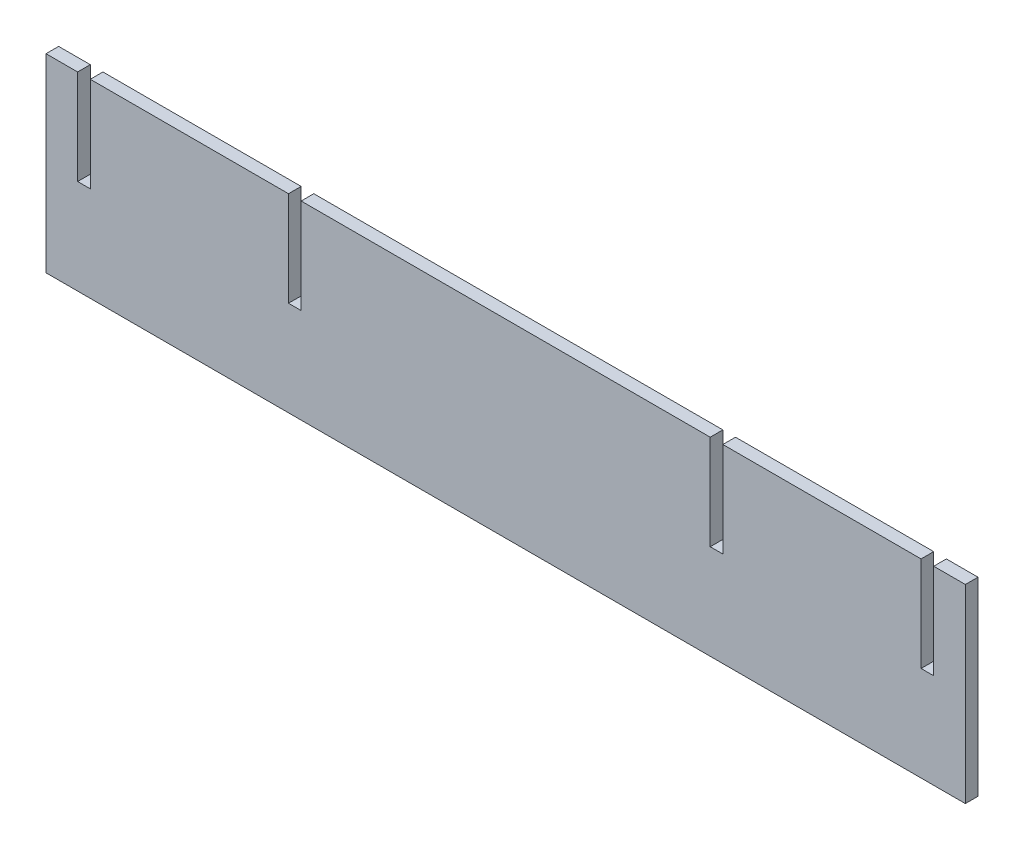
ISO-10303-21;
HEADER;
FILE_DESCRIPTION(('STEP AP214'),'2;1');
FILE_NAME('part.step','',(''),(''),'','','');
FILE_SCHEMA(('AUTOMOTIVE_DESIGN { 1 0 10303 214 1 1 1 1 }'));
ENDSEC;
DATA;
#1=APPLICATION_CONTEXT('core data for automotive mechanical design processes');
#2=APPLICATION_PROTOCOL_DEFINITION('international standard','automotive_design',2000,#1);
#3=PRODUCT_CONTEXT('',#1,'mechanical');
#4=PRODUCT('Part','Part','',(#3));
#5=PRODUCT_RELATED_PRODUCT_CATEGORY('part','',(#4));
#6=PRODUCT_DEFINITION_FORMATION('','',#4);
#7=PRODUCT_DEFINITION_CONTEXT('part definition',#1,'design');
#8=PRODUCT_DEFINITION('design','',#6,#7);
#9=PRODUCT_DEFINITION_SHAPE('','',#8);
#10=(LENGTH_UNIT() NAMED_UNIT(*) SI_UNIT(.MILLI.,.METRE.));
#11=(NAMED_UNIT(*) PLANE_ANGLE_UNIT() SI_UNIT($,.RADIAN.));
#12=(NAMED_UNIT(*) SI_UNIT($,.STERADIAN.) SOLID_ANGLE_UNIT());
#13=UNCERTAINTY_MEASURE_WITH_UNIT(LENGTH_MEASURE(1.E-05),#10,'distance_accuracy_value','');
#14=(GEOMETRIC_REPRESENTATION_CONTEXT(3) GLOBAL_UNCERTAINTY_ASSIGNED_CONTEXT((#13)) GLOBAL_UNIT_ASSIGNED_CONTEXT((#10,
#11,#12)) REPRESENTATION_CONTEXT('',''));
#15=CARTESIAN_POINT('',(0.,0.,0.));
#16=DIRECTION('',(0.,0.,1.));
#17=DIRECTION('',(1.,0.,0.));
#18=AXIS2_PLACEMENT_3D('',#15,#16,#17);
#19=CARTESIAN_POINT('',(0.,90.,12.));
#20=DIRECTION('',(0.,1.,0.));
#21=DIRECTION('',(-1.,0.,0.));
#22=AXIS2_PLACEMENT_3D('',#19,#20,#21);
#23=PLANE('',#22);
#24=DIRECTION('',(1.,0.,0.));
#25=VECTOR('',#24,1.);
#26=CARTESIAN_POINT('',(0.,90.,0.));
#27=LINE('',#26,#25);
#28=CARTESIAN_POINT('',(-394.,89.9999999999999,0.));
#29=VERTEX_POINT('',#28);
#30=CARTESIAN_POINT('',(-206.,90.,0.));
#31=VERTEX_POINT('',#30);
#32=EDGE_CURVE('E223',#29,#31,#27,.T.);
#33=ORIENTED_EDGE('',*,*,#32,.F.);
#34=DIRECTION('',(0.,0.,-1.));
#35=VECTOR('',#34,1.);
#36=CARTESIAN_POINT('',(-394.,89.9999999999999,12.));
#37=LINE('',#36,#35);
#38=CARTESIAN_POINT('',(-394.,89.9999999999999,12.));
#39=VERTEX_POINT('',#38);
#40=EDGE_CURVE('E11',#39,#29,#37,.T.);
#41=ORIENTED_EDGE('',*,*,#40,.F.);
#42=DIRECTION('',(1.,0.,0.));
#43=VECTOR('',#42,1.);
#44=CARTESIAN_POINT('',(0.,90.,12.));
#45=LINE('',#44,#43);
#46=CARTESIAN_POINT('',(-206.,90.,12.));
#47=VERTEX_POINT('',#46);
#48=EDGE_CURVE('E286',#39,#47,#45,.T.);
#49=ORIENTED_EDGE('',*,*,#48,.T.);
#50=DIRECTION('',(0.,0.,-1.));
#51=VECTOR('',#50,1.);
#52=CARTESIAN_POINT('',(-206.,90.,12.));
#53=LINE('',#52,#51);
#54=EDGE_CURVE('E67',#47,#31,#53,.T.);
#55=ORIENTED_EDGE('',*,*,#54,.T.);
#56=EDGE_LOOP('',(#33,#41,#49,#55));
#57=FACE_BOUND('',#56,.T.);
#58=ADVANCED_FACE('F49',(#57),#23,.T.);
#59=CARTESIAN_POINT('',(-394.,-2.43015484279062E-13,12.));
#60=DIRECTION('',(1.,0.,0.));
#61=DIRECTION('',(0.,1.,0.));
#62=AXIS2_PLACEMENT_3D('',#59,#60,#61);
#63=PLANE('',#62);
#64=DIRECTION('',(0.,-1.,0.));
#65=VECTOR('',#64,1.);
#66=CARTESIAN_POINT('',(-394.,-2.43015484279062E-13,0.));
#67=LINE('',#66,#65);
#68=CARTESIAN_POINT('',(-394.,0.,0.));
#69=VERTEX_POINT('',#68);
#70=EDGE_CURVE('E226',#29,#69,#67,.T.);
#71=ORIENTED_EDGE('',*,*,#70,.T.);
#72=DIRECTION('',(0.,0.,-1.));
#73=VECTOR('',#72,1.);
#74=CARTESIAN_POINT('',(-394.,0.,12.));
#75=LINE('',#74,#73);
#76=CARTESIAN_POINT('',(-394.,0.,12.));
#77=VERTEX_POINT('',#76);
#78=EDGE_CURVE('E59',#77,#69,#75,.T.);
#79=ORIENTED_EDGE('',*,*,#78,.F.);
#80=DIRECTION('',(0.,-1.,0.));
#81=VECTOR('',#80,1.);
#82=CARTESIAN_POINT('',(-394.,-2.43015484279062E-13,12.));
#83=LINE('',#82,#81);
#84=EDGE_CURVE('E359',#39,#77,#83,.T.);
#85=ORIENTED_EDGE('',*,*,#84,.F.);
#86=ORIENTED_EDGE('',*,*,#40,.T.);
#87=EDGE_LOOP('',(#71,#79,#85,#86));
#88=FACE_BOUND('',#87,.T.);
#89=ADVANCED_FACE('F51',(#88),#63,.F.);
#90=CARTESIAN_POINT('',(0.,0.,12.));
#91=DIRECTION('',(0.,1.,0.));
#92=DIRECTION('',(-1.,0.,0.));
#93=AXIS2_PLACEMENT_3D('',#90,#91,#92);
#94=PLANE('',#93);
#95=DIRECTION('',(1.,0.,0.));
#96=VECTOR('',#95,1.);
#97=CARTESIAN_POINT('',(0.,0.,0.));
#98=LINE('',#97,#96);
#99=CARTESIAN_POINT('',(-406.,0.,0.));
#100=VERTEX_POINT('',#99);
#101=EDGE_CURVE('E232',#100,#69,#98,.T.);
#102=ORIENTED_EDGE('',*,*,#101,.F.);
#103=DIRECTION('',(0.,0.,-1.));
#104=VECTOR('',#103,1.);
#105=CARTESIAN_POINT('',(-406.,0.,12.));
#106=LINE('',#105,#104);
#107=CARTESIAN_POINT('',(-406.,0.,12.));
#108=VERTEX_POINT('',#107);
#109=EDGE_CURVE('E333',#108,#100,#106,.T.);
#110=ORIENTED_EDGE('',*,*,#109,.F.);
#111=DIRECTION('',(1.,0.,0.));
#112=VECTOR('',#111,1.);
#113=CARTESIAN_POINT('',(0.,0.,12.));
#114=LINE('',#113,#112);
#115=EDGE_CURVE('E344',#108,#77,#114,.T.);
#116=ORIENTED_EDGE('',*,*,#115,.T.);
#117=ORIENTED_EDGE('',*,*,#78,.T.);
#118=EDGE_LOOP('',(#102,#110,#116,#117));
#119=FACE_BOUND('',#118,.T.);
#120=ADVANCED_FACE('F342',(#119),#94,.T.);
#121=CARTESIAN_POINT('',(-406.,0.,12.));
#122=DIRECTION('',(1.,0.,0.));
#123=DIRECTION('',(0.,0.,-1.));
#124=AXIS2_PLACEMENT_3D('',#121,#122,#123);
#125=PLANE('',#124);
#126=DIRECTION('',(0.,-1.,0.));
#127=VECTOR('',#126,1.);
#128=CARTESIAN_POINT('',(-406.,0.,0.));
#129=LINE('',#128,#127);
#130=CARTESIAN_POINT('',(-406.,89.9999999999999,0.));
#131=VERTEX_POINT('',#130);
#132=EDGE_CURVE('E236',#131,#100,#129,.T.);
#133=ORIENTED_EDGE('',*,*,#132,.F.);
#134=DIRECTION('',(0.,0.,-1.));
#135=VECTOR('',#134,1.);
#136=CARTESIAN_POINT('',(-406.,89.9999999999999,12.));
#137=LINE('',#136,#135);
#138=CARTESIAN_POINT('',(-406.,89.9999999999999,12.));
#139=VERTEX_POINT('',#138);
#140=EDGE_CURVE('E330',#139,#131,#137,.T.);
#141=ORIENTED_EDGE('',*,*,#140,.F.);
#142=DIRECTION('',(0.,-1.,0.));
#143=VECTOR('',#142,1.);
#144=CARTESIAN_POINT('',(-406.,0.,12.));
#145=LINE('',#144,#143);
#146=EDGE_CURVE('E356',#139,#108,#145,.T.);
#147=ORIENTED_EDGE('',*,*,#146,.T.);
#148=ORIENTED_EDGE('',*,*,#109,.T.);
#149=EDGE_LOOP('',(#133,#141,#147,#148));
#150=FACE_BOUND('',#149,.T.);
#151=ADVANCED_FACE('F353',(#150),#125,.T.);
#152=CARTESIAN_POINT('',(-436.,89.9999999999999,0.));
#153=VERTEX_POINT('',#152);
#154=EDGE_CURVE('E228',#153,#131,#27,.T.);
#155=ORIENTED_EDGE('',*,*,#154,.F.);
#156=DIRECTION('',(0.,0.,-1.));
#157=VECTOR('',#156,1.);
#158=CARTESIAN_POINT('',(-436.,89.9999999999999,12.));
#159=LINE('',#158,#157);
#160=CARTESIAN_POINT('',(-436.,89.9999999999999,12.));
#161=VERTEX_POINT('',#160);
#162=EDGE_CURVE('E327',#161,#153,#159,.T.);
#163=ORIENTED_EDGE('',*,*,#162,.F.);
#164=EDGE_CURVE('E366',#161,#139,#45,.T.);
#165=ORIENTED_EDGE('',*,*,#164,.T.);
#166=ORIENTED_EDGE('',*,*,#140,.T.);
#167=EDGE_LOOP('',(#155,#163,#165,#166));
#168=FACE_BOUND('',#167,.T.);
#169=ADVANCED_FACE('F486',(#168),#23,.T.);
#170=CARTESIAN_POINT('',(-436.,0.,12.));
#171=DIRECTION('',(-1.,0.,0.));
#172=DIRECTION('',(0.,0.,1.));
#173=AXIS2_PLACEMENT_3D('',#170,#171,#172);
#174=PLANE('',#173);
#175=DIRECTION('',(0.,1.,0.));
#176=VECTOR('',#175,1.);
#177=CARTESIAN_POINT('',(-436.,0.,0.));
#178=LINE('',#177,#176);
#179=CARTESIAN_POINT('',(-436.,-90.0000000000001,0.));
#180=VERTEX_POINT('',#179);
#181=EDGE_CURVE('E240',#180,#153,#178,.T.);
#182=ORIENTED_EDGE('',*,*,#181,.F.);
#183=DIRECTION('',(0.,0.,-1.));
#184=VECTOR('',#183,1.);
#185=CARTESIAN_POINT('',(-436.,-90.0000000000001,12.));
#186=LINE('',#185,#184);
#187=CARTESIAN_POINT('',(-436.,-90.0000000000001,12.));
#188=VERTEX_POINT('',#187);
#189=EDGE_CURVE('E324',#188,#180,#186,.T.);
#190=ORIENTED_EDGE('',*,*,#189,.F.);
#191=DIRECTION('',(0.,1.,0.));
#192=VECTOR('',#191,1.);
#193=CARTESIAN_POINT('',(-436.,0.,12.));
#194=LINE('',#193,#192);
#195=EDGE_CURVE('E371',#188,#161,#194,.T.);
#196=ORIENTED_EDGE('',*,*,#195,.T.);
#197=ORIENTED_EDGE('',*,*,#162,.T.);
#198=EDGE_LOOP('',(#182,#190,#196,#197));
#199=FACE_BOUND('',#198,.T.);
#200=ADVANCED_FACE('F495',(#199),#174,.T.);
#201=CARTESIAN_POINT('',(0.,-90.,12.));
#202=DIRECTION('',(0.,1.,0.));
#203=DIRECTION('',(-1.,0.,0.));
#204=AXIS2_PLACEMENT_3D('',#201,#202,#203);
#205=PLANE('',#204);
#206=DIRECTION('',(1.,0.,0.));
#207=VECTOR('',#206,1.);
#208=CARTESIAN_POINT('',(0.,-90.,0.));
#209=LINE('',#208,#207);
#210=CARTESIAN_POINT('',(436.,-90.,0.));
#211=VERTEX_POINT('',#210);
#212=EDGE_CURVE('E244',#180,#211,#209,.T.);
#213=ORIENTED_EDGE('',*,*,#212,.T.);
#214=DIRECTION('',(0.,0.,-1.));
#215=VECTOR('',#214,1.);
#216=CARTESIAN_POINT('',(436.,-90.,12.));
#217=LINE('',#216,#215);
#218=CARTESIAN_POINT('',(436.,-90.,12.));
#219=VERTEX_POINT('',#218);
#220=EDGE_CURVE('E320',#219,#211,#217,.T.);
#221=ORIENTED_EDGE('',*,*,#220,.F.);
#222=DIRECTION('',(1.,0.,0.));
#223=VECTOR('',#222,1.);
#224=CARTESIAN_POINT('',(0.,-90.,12.));
#225=LINE('',#224,#223);
#226=EDGE_CURVE('E375',#188,#219,#225,.T.);
#227=ORIENTED_EDGE('',*,*,#226,.F.);
#228=ORIENTED_EDGE('',*,*,#189,.T.);
#229=EDGE_LOOP('',(#213,#221,#227,#228));
#230=FACE_BOUND('',#229,.T.);
#231=ADVANCED_FACE('F601',(#230),#205,.F.);
#232=CARTESIAN_POINT('',(436.,0.,12.));
#233=DIRECTION('',(-1.,0.,0.));
#234=DIRECTION('',(0.,0.,1.));
#235=AXIS2_PLACEMENT_3D('',#232,#233,#234);
#236=PLANE('',#235);
#237=DIRECTION('',(0.,1.,0.));
#238=VECTOR('',#237,1.);
#239=CARTESIAN_POINT('',(436.,0.,0.));
#240=LINE('',#239,#238);
#241=CARTESIAN_POINT('',(436.,90.,0.));
#242=VERTEX_POINT('',#241);
#243=EDGE_CURVE('E247',#211,#242,#240,.T.);
#244=ORIENTED_EDGE('',*,*,#243,.T.);
#245=DIRECTION('',(0.,0.,-1.));
#246=VECTOR('',#245,1.);
#247=CARTESIAN_POINT('',(436.,90.,12.));
#248=LINE('',#247,#246);
#249=CARTESIAN_POINT('',(436.,90.,12.));
#250=VERTEX_POINT('',#249);
#251=EDGE_CURVE('E317',#250,#242,#248,.T.);
#252=ORIENTED_EDGE('',*,*,#251,.F.);
#253=DIRECTION('',(0.,1.,0.));
#254=VECTOR('',#253,1.);
#255=CARTESIAN_POINT('',(436.,0.,12.));
#256=LINE('',#255,#254);
#257=EDGE_CURVE('E378',#219,#250,#256,.T.);
#258=ORIENTED_EDGE('',*,*,#257,.F.);
#259=ORIENTED_EDGE('',*,*,#220,.T.);
#260=EDGE_LOOP('',(#244,#252,#258,#259));
#261=FACE_BOUND('',#260,.T.);
#262=ADVANCED_FACE('F436',(#261),#236,.F.);
#263=CARTESIAN_POINT('',(406.,90.,0.));
#264=VERTEX_POINT('',#263);
#265=EDGE_CURVE('E251',#264,#242,#27,.T.);
#266=ORIENTED_EDGE('',*,*,#265,.F.);
#267=DIRECTION('',(0.,0.,-1.));
#268=VECTOR('',#267,1.);
#269=CARTESIAN_POINT('',(406.,90.,12.));
#270=LINE('',#269,#268);
#271=CARTESIAN_POINT('',(406.,90.,12.));
#272=VERTEX_POINT('',#271);
#273=EDGE_CURVE('E314',#272,#264,#270,.T.);
#274=ORIENTED_EDGE('',*,*,#273,.F.);
#275=EDGE_CURVE('E381',#272,#250,#45,.T.);
#276=ORIENTED_EDGE('',*,*,#275,.T.);
#277=ORIENTED_EDGE('',*,*,#251,.T.);
#278=EDGE_LOOP('',(#266,#274,#276,#277));
#279=FACE_BOUND('',#278,.T.);
#280=ADVANCED_FACE('F426',(#279),#23,.T.);
#281=CARTESIAN_POINT('',(406.,2.50416971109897E-13,12.));
#282=DIRECTION('',(1.,0.,0.));
#283=DIRECTION('',(0.,1.,0.));
#284=AXIS2_PLACEMENT_3D('',#281,#282,#283);
#285=PLANE('',#284);
#286=DIRECTION('',(0.,-1.,0.));
#287=VECTOR('',#286,1.);
#288=CARTESIAN_POINT('',(406.,2.50416971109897E-13,0.));
#289=LINE('',#288,#287);
#290=CARTESIAN_POINT('',(406.,0.,0.));
#291=VERTEX_POINT('',#290);
#292=EDGE_CURVE('E252',#264,#291,#289,.T.);
#293=ORIENTED_EDGE('',*,*,#292,.T.);
#294=DIRECTION('',(0.,0.,-1.));
#295=VECTOR('',#294,1.);
#296=CARTESIAN_POINT('',(406.,0.,12.));
#297=LINE('',#296,#295);
#298=CARTESIAN_POINT('',(406.,0.,12.));
#299=VERTEX_POINT('',#298);
#300=EDGE_CURVE('E311',#299,#291,#297,.T.);
#301=ORIENTED_EDGE('',*,*,#300,.F.);
#302=DIRECTION('',(0.,-1.,0.));
#303=VECTOR('',#302,1.);
#304=CARTESIAN_POINT('',(406.,2.50416971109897E-13,12.));
#305=LINE('',#304,#303);
#306=EDGE_CURVE('E382',#272,#299,#305,.T.);
#307=ORIENTED_EDGE('',*,*,#306,.F.);
#308=ORIENTED_EDGE('',*,*,#273,.T.);
#309=EDGE_LOOP('',(#293,#301,#307,#308));
#310=FACE_BOUND('',#309,.T.);
#311=ADVANCED_FACE('F477',(#310),#285,.F.);
#312=CARTESIAN_POINT('',(0.,0.,12.));
#313=DIRECTION('',(0.,1.,0.));
#314=DIRECTION('',(-1.,0.,0.));
#315=AXIS2_PLACEMENT_3D('',#312,#313,#314);
#316=PLANE('',#315);
#317=DIRECTION('',(1.,0.,0.));
#318=VECTOR('',#317,1.);
#319=CARTESIAN_POINT('',(0.,0.,0.));
#320=LINE('',#319,#318);
#321=CARTESIAN_POINT('',(394.,0.,0.));
#322=VERTEX_POINT('',#321);
#323=EDGE_CURVE('E256',#322,#291,#320,.T.);
#324=ORIENTED_EDGE('',*,*,#323,.F.);
#325=DIRECTION('',(0.,0.,-1.));
#326=VECTOR('',#325,1.);
#327=CARTESIAN_POINT('',(394.,0.,12.));
#328=LINE('',#327,#326);
#329=CARTESIAN_POINT('',(394.,0.,12.));
#330=VERTEX_POINT('',#329);
#331=EDGE_CURVE('E308',#330,#322,#328,.T.);
#332=ORIENTED_EDGE('',*,*,#331,.F.);
#333=DIRECTION('',(1.,0.,0.));
#334=VECTOR('',#333,1.);
#335=CARTESIAN_POINT('',(0.,0.,12.));
#336=LINE('',#335,#334);
#337=EDGE_CURVE('E385',#330,#299,#336,.T.);
#338=ORIENTED_EDGE('',*,*,#337,.T.);
#339=ORIENTED_EDGE('',*,*,#300,.T.);
#340=EDGE_LOOP('',(#324,#332,#338,#339));
#341=FACE_BOUND('',#340,.T.);
#342=ADVANCED_FACE('F475',(#341),#316,.T.);
#343=CARTESIAN_POINT('',(394.,0.,12.));
#344=DIRECTION('',(1.,0.,0.));
#345=DIRECTION('',(0.,0.,-1.));
#346=AXIS2_PLACEMENT_3D('',#343,#344,#345);
#347=PLANE('',#346);
#348=DIRECTION('',(0.,-1.,0.));
#349=VECTOR('',#348,1.);
#350=CARTESIAN_POINT('',(394.,0.,0.));
#351=LINE('',#350,#349);
#352=CARTESIAN_POINT('',(394.,90.,0.));
#353=VERTEX_POINT('',#352);
#354=EDGE_CURVE('E260',#353,#322,#351,.T.);
#355=ORIENTED_EDGE('',*,*,#354,.F.);
#356=DIRECTION('',(0.,0.,-1.));
#357=VECTOR('',#356,1.);
#358=CARTESIAN_POINT('',(394.,90.,12.));
#359=LINE('',#358,#357);
#360=CARTESIAN_POINT('',(394.,90.,12.));
#361=VERTEX_POINT('',#360);
#362=EDGE_CURVE('E305',#361,#353,#359,.T.);
#363=ORIENTED_EDGE('',*,*,#362,.F.);
#364=DIRECTION('',(0.,-1.,0.));
#365=VECTOR('',#364,1.);
#366=CARTESIAN_POINT('',(394.,0.,12.));
#367=LINE('',#366,#365);
#368=EDGE_CURVE('E389',#361,#330,#367,.T.);
#369=ORIENTED_EDGE('',*,*,#368,.T.);
#370=ORIENTED_EDGE('',*,*,#331,.T.);
#371=EDGE_LOOP('',(#355,#363,#369,#370));
#372=FACE_BOUND('',#371,.T.);
#373=ADVANCED_FACE('F472',(#372),#347,.T.);
#374=CARTESIAN_POINT('',(206.,90.,0.));
#375=VERTEX_POINT('',#374);
#376=EDGE_CURVE('E264',#375,#353,#27,.T.);
#377=ORIENTED_EDGE('',*,*,#376,.F.);
#378=DIRECTION('',(0.,0.,-1.));
#379=VECTOR('',#378,1.);
#380=CARTESIAN_POINT('',(206.,90.,12.));
#381=LINE('',#380,#379);
#382=CARTESIAN_POINT('',(206.,90.,12.));
#383=VERTEX_POINT('',#382);
#384=EDGE_CURVE('E302',#383,#375,#381,.T.);
#385=ORIENTED_EDGE('',*,*,#384,.F.);
#386=EDGE_CURVE('E393',#383,#361,#45,.T.);
#387=ORIENTED_EDGE('',*,*,#386,.T.);
#388=ORIENTED_EDGE('',*,*,#362,.T.);
#389=EDGE_LOOP('',(#377,#385,#387,#388));
#390=FACE_BOUND('',#389,.T.);
#391=ADVANCED_FACE('F466',(#390),#23,.T.);
#392=CARTESIAN_POINT('',(206.,1.27058857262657E-13,12.));
#393=DIRECTION('',(1.,0.,0.));
#394=DIRECTION('',(0.,1.,0.));
#395=AXIS2_PLACEMENT_3D('',#392,#393,#394);
#396=PLANE('',#395);
#397=DIRECTION('',(0.,-1.,0.));
#398=VECTOR('',#397,1.);
#399=CARTESIAN_POINT('',(206.,1.27058857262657E-13,0.));
#400=LINE('',#399,#398);
#401=CARTESIAN_POINT('',(206.,0.,0.));
#402=VERTEX_POINT('',#401);
#403=EDGE_CURVE('E265',#375,#402,#400,.T.);
#404=ORIENTED_EDGE('',*,*,#403,.T.);
#405=DIRECTION('',(0.,0.,-1.));
#406=VECTOR('',#405,1.);
#407=CARTESIAN_POINT('',(206.,0.,12.));
#408=LINE('',#407,#406);
#409=CARTESIAN_POINT('',(206.,0.,12.));
#410=VERTEX_POINT('',#409);
#411=EDGE_CURVE('E299',#410,#402,#408,.T.);
#412=ORIENTED_EDGE('',*,*,#411,.F.);
#413=DIRECTION('',(0.,-1.,0.));
#414=VECTOR('',#413,1.);
#415=CARTESIAN_POINT('',(206.,1.27058857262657E-13,12.));
#416=LINE('',#415,#414);
#417=EDGE_CURVE('E394',#383,#410,#416,.T.);
#418=ORIENTED_EDGE('',*,*,#417,.F.);
#419=ORIENTED_EDGE('',*,*,#384,.T.);
#420=EDGE_LOOP('',(#404,#412,#418,#419));
#421=FACE_BOUND('',#420,.T.);
#422=ADVANCED_FACE('F502',(#421),#396,.F.);
#423=CARTESIAN_POINT('',(0.,0.,12.));
#424=DIRECTION('',(0.,1.,0.));
#425=DIRECTION('',(-1.,0.,0.));
#426=AXIS2_PLACEMENT_3D('',#423,#424,#425);
#427=PLANE('',#426);
#428=DIRECTION('',(1.,0.,0.));
#429=VECTOR('',#428,1.);
#430=CARTESIAN_POINT('',(0.,0.,0.));
#431=LINE('',#430,#429);
#432=CARTESIAN_POINT('',(194.,0.,0.));
#433=VERTEX_POINT('',#432);
#434=EDGE_CURVE('E269',#433,#402,#431,.T.);
#435=ORIENTED_EDGE('',*,*,#434,.F.);
#436=DIRECTION('',(0.,0.,-1.));
#437=VECTOR('',#436,1.);
#438=CARTESIAN_POINT('',(194.,0.,12.));
#439=LINE('',#438,#437);
#440=CARTESIAN_POINT('',(194.,0.,12.));
#441=VERTEX_POINT('',#440);
#442=EDGE_CURVE('E296',#441,#433,#439,.T.);
#443=ORIENTED_EDGE('',*,*,#442,.F.);
#444=DIRECTION('',(1.,0.,0.));
#445=VECTOR('',#444,1.);
#446=CARTESIAN_POINT('',(0.,0.,12.));
#447=LINE('',#446,#445);
#448=EDGE_CURVE('E397',#441,#410,#447,.T.);
#449=ORIENTED_EDGE('',*,*,#448,.T.);
#450=ORIENTED_EDGE('',*,*,#411,.T.);
#451=EDGE_LOOP('',(#435,#443,#449,#450));
#452=FACE_BOUND('',#451,.T.);
#453=ADVANCED_FACE('F462',(#452),#427,.T.);
#454=CARTESIAN_POINT('',(194.,0.,12.));
#455=DIRECTION('',(1.,0.,0.));
#456=DIRECTION('',(0.,0.,-1.));
#457=AXIS2_PLACEMENT_3D('',#454,#455,#456);
#458=PLANE('',#457);
#459=DIRECTION('',(0.,-1.,0.));
#460=VECTOR('',#459,1.);
#461=CARTESIAN_POINT('',(194.,0.,0.));
#462=LINE('',#461,#460);
#463=CARTESIAN_POINT('',(194.,90.,0.));
#464=VERTEX_POINT('',#463);
#465=EDGE_CURVE('E273',#464,#433,#462,.T.);
#466=ORIENTED_EDGE('',*,*,#465,.F.);
#467=DIRECTION('',(0.,0.,-1.));
#468=VECTOR('',#467,1.);
#469=CARTESIAN_POINT('',(194.,90.,12.));
#470=LINE('',#469,#468);
#471=CARTESIAN_POINT('',(194.,90.,12.));
#472=VERTEX_POINT('',#471);
#473=EDGE_CURVE('E293',#472,#464,#470,.T.);
#474=ORIENTED_EDGE('',*,*,#473,.F.);
#475=DIRECTION('',(0.,-1.,0.));
#476=VECTOR('',#475,1.);
#477=CARTESIAN_POINT('',(194.,0.,12.));
#478=LINE('',#477,#476);
#479=EDGE_CURVE('E400',#472,#441,#478,.T.);
#480=ORIENTED_EDGE('',*,*,#479,.T.);
#481=ORIENTED_EDGE('',*,*,#442,.T.);
#482=EDGE_LOOP('',(#466,#474,#480,#481));
#483=FACE_BOUND('',#482,.T.);
#484=ADVANCED_FACE('F458',(#483),#458,.T.);
#485=CARTESIAN_POINT('',(-194.,90.,0.));
#486=VERTEX_POINT('',#485);
#487=EDGE_CURVE('E227',#486,#464,#27,.T.);
#488=ORIENTED_EDGE('',*,*,#487,.F.);
#489=DIRECTION('',(0.,0.,-1.));
#490=VECTOR('',#489,1.);
#491=CARTESIAN_POINT('',(-194.,90.,12.));
#492=LINE('',#491,#490);
#493=CARTESIAN_POINT('',(-194.,90.,12.));
#494=VERTEX_POINT('',#493);
#495=EDGE_CURVE('E211',#494,#486,#492,.T.);
#496=ORIENTED_EDGE('',*,*,#495,.F.);
#497=EDGE_CURVE('E199',#494,#472,#45,.T.);
#498=ORIENTED_EDGE('',*,*,#497,.T.);
#499=ORIENTED_EDGE('',*,*,#473,.T.);
#500=EDGE_LOOP('',(#488,#496,#498,#499));
#501=FACE_BOUND('',#500,.T.);
#502=ADVANCED_FACE('F457',(#501),#23,.T.);
#503=CARTESIAN_POINT('',(-194.,-1.19657370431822E-13,12.));
#504=DIRECTION('',(1.,0.,0.));
#505=DIRECTION('',(0.,1.,0.));
#506=AXIS2_PLACEMENT_3D('',#503,#504,#505);
#507=PLANE('',#506);
#508=DIRECTION('',(0.,-1.,0.));
#509=VECTOR('',#508,1.);
#510=CARTESIAN_POINT('',(-194.,-1.19657370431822E-13,0.));
#511=LINE('',#510,#509);
#512=CARTESIAN_POINT('',(-194.,0.,0.));
#513=VERTEX_POINT('',#512);
#514=EDGE_CURVE('E207',#486,#513,#511,.T.);
#515=ORIENTED_EDGE('',*,*,#514,.T.);
#516=DIRECTION('',(0.,0.,-1.));
#517=VECTOR('',#516,1.);
#518=CARTESIAN_POINT('',(-194.,0.,12.));
#519=LINE('',#518,#517);
#520=CARTESIAN_POINT('',(-194.,0.,12.));
#521=VERTEX_POINT('',#520);
#522=EDGE_CURVE('E204',#521,#513,#519,.T.);
#523=ORIENTED_EDGE('',*,*,#522,.F.);
#524=DIRECTION('',(0.,-1.,0.));
#525=VECTOR('',#524,1.);
#526=CARTESIAN_POINT('',(-194.,-1.19657370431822E-13,12.));
#527=LINE('',#526,#525);
#528=EDGE_CURVE('E190',#494,#521,#527,.T.);
#529=ORIENTED_EDGE('',*,*,#528,.F.);
#530=ORIENTED_EDGE('',*,*,#495,.T.);
#531=EDGE_LOOP('',(#515,#523,#529,#530));
#532=FACE_BOUND('',#531,.T.);
#533=ADVANCED_FACE('F205',(#532),#507,.F.);
#534=CARTESIAN_POINT('',(0.,0.,12.));
#535=DIRECTION('',(0.,1.,0.));
#536=DIRECTION('',(-1.,0.,0.));
#537=AXIS2_PLACEMENT_3D('',#534,#535,#536);
#538=PLANE('',#537);
#539=DIRECTION('',(1.,0.,0.));
#540=VECTOR('',#539,1.);
#541=CARTESIAN_POINT('',(0.,0.,0.));
#542=LINE('',#541,#540);
#543=CARTESIAN_POINT('',(-206.,0.,0.));
#544=VERTEX_POINT('',#543);
#545=EDGE_CURVE('E279',#544,#513,#542,.T.);
#546=ORIENTED_EDGE('',*,*,#545,.F.);
#547=DIRECTION('',(0.,0.,-1.));
#548=VECTOR('',#547,1.);
#549=CARTESIAN_POINT('',(-206.,0.,12.));
#550=LINE('',#549,#548);
#551=CARTESIAN_POINT('',(-206.,0.,12.));
#552=VERTEX_POINT('',#551);
#553=EDGE_CURVE('E128',#552,#544,#550,.T.);
#554=ORIENTED_EDGE('',*,*,#553,.F.);
#555=DIRECTION('',(1.,0.,0.));
#556=VECTOR('',#555,1.);
#557=CARTESIAN_POINT('',(0.,0.,12.));
#558=LINE('',#557,#556);
#559=EDGE_CURVE('E196',#552,#521,#558,.T.);
#560=ORIENTED_EDGE('',*,*,#559,.T.);
#561=ORIENTED_EDGE('',*,*,#522,.T.);
#562=EDGE_LOOP('',(#546,#554,#560,#561));
#563=FACE_BOUND('',#562,.T.);
#564=ADVANCED_FACE('F213',(#563),#538,.T.);
#565=CARTESIAN_POINT('',(-206.,0.,12.));
#566=DIRECTION('',(1.,0.,0.));
#567=DIRECTION('',(0.,0.,-1.));
#568=AXIS2_PLACEMENT_3D('',#565,#566,#567);
#569=PLANE('',#568);
#570=DIRECTION('',(0.,-1.,0.));
#571=VECTOR('',#570,1.);
#572=CARTESIAN_POINT('',(-206.,0.,0.));
#573=LINE('',#572,#571);
#574=EDGE_CURVE('E282',#31,#544,#573,.T.);
#575=ORIENTED_EDGE('',*,*,#574,.F.);
#576=ORIENTED_EDGE('',*,*,#54,.F.);
#577=DIRECTION('',(0.,-1.,0.));
#578=VECTOR('',#577,1.);
#579=CARTESIAN_POINT('',(-206.,0.,12.));
#580=LINE('',#579,#578);
#581=EDGE_CURVE('E215',#47,#552,#580,.T.);
#582=ORIENTED_EDGE('',*,*,#581,.T.);
#583=ORIENTED_EDGE('',*,*,#553,.T.);
#584=EDGE_LOOP('',(#575,#576,#582,#583));
#585=FACE_BOUND('',#584,.T.);
#586=ADVANCED_FACE('F542',(#585),#569,.T.);
#587=CARTESIAN_POINT('',(0.,0.,12.));
#588=DIRECTION('',(0.,0.,1.));
#589=DIRECTION('',(1.,0.,0.));
#590=AXIS2_PLACEMENT_3D('',#587,#588,#589);
#591=PLANE('',#590);
#592=ORIENTED_EDGE('',*,*,#48,.F.);
#593=ORIENTED_EDGE('',*,*,#84,.T.);
#594=ORIENTED_EDGE('',*,*,#115,.F.);
#595=ORIENTED_EDGE('',*,*,#146,.F.);
#596=ORIENTED_EDGE('',*,*,#164,.F.);
#597=ORIENTED_EDGE('',*,*,#195,.F.);
#598=ORIENTED_EDGE('',*,*,#226,.T.);
#599=ORIENTED_EDGE('',*,*,#257,.T.);
#600=ORIENTED_EDGE('',*,*,#275,.F.);
#601=ORIENTED_EDGE('',*,*,#306,.T.);
#602=ORIENTED_EDGE('',*,*,#337,.F.);
#603=ORIENTED_EDGE('',*,*,#368,.F.);
#604=ORIENTED_EDGE('',*,*,#386,.F.);
#605=ORIENTED_EDGE('',*,*,#417,.T.);
#606=ORIENTED_EDGE('',*,*,#448,.F.);
#607=ORIENTED_EDGE('',*,*,#479,.F.);
#608=ORIENTED_EDGE('',*,*,#497,.F.);
#609=ORIENTED_EDGE('',*,*,#528,.T.);
#610=ORIENTED_EDGE('',*,*,#559,.F.);
#611=ORIENTED_EDGE('',*,*,#581,.F.);
#612=EDGE_LOOP('',(#592,#593,#594,#595,#596,#597,#598,#599,#600,#601,#602,#603,#604,#605,#606,
#607,#608,#609,#610,#611));
#613=FACE_BOUND('',#612,.T.);
#614=ADVANCED_FACE('F193',(#613),#591,.T.);
#615=CARTESIAN_POINT('',(0.,0.,0.));
#616=DIRECTION('',(0.,0.,1.));
#617=DIRECTION('',(1.,0.,0.));
#618=AXIS2_PLACEMENT_3D('',#615,#616,#617);
#619=PLANE('',#618);
#620=ORIENTED_EDGE('',*,*,#32,.T.);
#621=ORIENTED_EDGE('',*,*,#574,.T.);
#622=ORIENTED_EDGE('',*,*,#545,.T.);
#623=ORIENTED_EDGE('',*,*,#514,.F.);
#624=ORIENTED_EDGE('',*,*,#487,.T.);
#625=ORIENTED_EDGE('',*,*,#465,.T.);
#626=ORIENTED_EDGE('',*,*,#434,.T.);
#627=ORIENTED_EDGE('',*,*,#403,.F.);
#628=ORIENTED_EDGE('',*,*,#376,.T.);
#629=ORIENTED_EDGE('',*,*,#354,.T.);
#630=ORIENTED_EDGE('',*,*,#323,.T.);
#631=ORIENTED_EDGE('',*,*,#292,.F.);
#632=ORIENTED_EDGE('',*,*,#265,.T.);
#633=ORIENTED_EDGE('',*,*,#243,.F.);
#634=ORIENTED_EDGE('',*,*,#212,.F.);
#635=ORIENTED_EDGE('',*,*,#181,.T.);
#636=ORIENTED_EDGE('',*,*,#154,.T.);
#637=ORIENTED_EDGE('',*,*,#132,.T.);
#638=ORIENTED_EDGE('',*,*,#101,.T.);
#639=ORIENTED_EDGE('',*,*,#70,.F.);
#640=EDGE_LOOP('',(#620,#621,#622,#623,#624,#625,#626,#627,#628,#629,#630,#631,#632,#633,#634,
#635,#636,#637,#638,#639));
#641=FACE_BOUND('',#640,.T.);
#642=ADVANCED_FACE('F348',(#641),#619,.F.);
#643=CLOSED_SHELL('',(#58,#89,#120,#151,#169,#200,#231,#262,#280,#311,#342,#373,#391,#422,#453,
#484,#502,#533,#564,#586,#614,#642));
#644=MANIFOLD_SOLID_BREP('B2',#643);
#645=ADVANCED_BREP_SHAPE_REPRESENTATION('',(#18,#644),#14);
#646=SHAPE_DEFINITION_REPRESENTATION(#9,#645);
ENDSEC;
END-ISO-10303-21;
